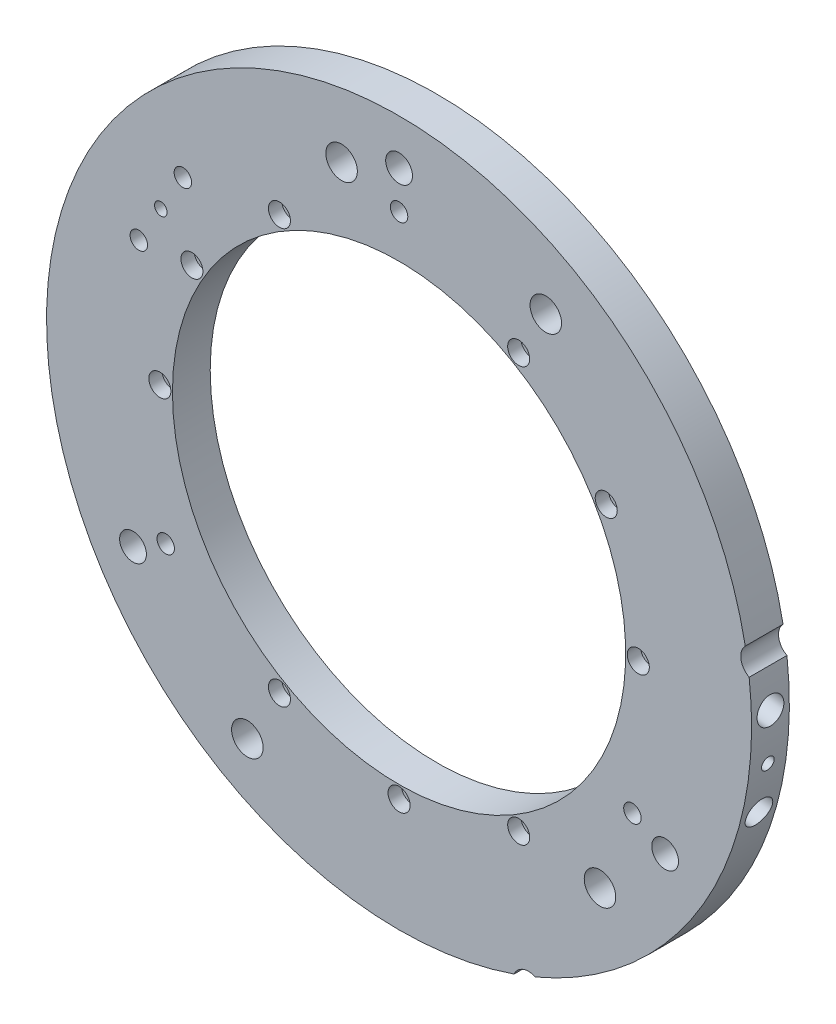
from build123d import *

# Parameters (mm, degrees)
SKETCH1_R           = 88.9
SKETCH1_R_2         = 57.15
BOSS_EXTRUDE1_DEPTH = 9.525
SKETCH2_R           = 3.3782
CUT_EXTRUDE1_DEPTH  = 127.083883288
SKETCH3_R           = 1.4732
CUT_EXTRUDE2_DEPTH  = 127.083883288
SKETCH5_R           = 2.778125
CUT_EXTRUDE4_DEPTH  = 3.3528
SKETCH7_R           = 2.1971
CUT_EXTRUDE6_DEPTH  = 127.083883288
SKETCH10_R          = 3.9751
CUT_EXTRUDE7_DEPTH  = 127.083883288
SKETCH15_R          = 3.3782
CUT_EXTRUDE8_DEPTH  = 19.05
SKETCH16_R          = 1.5875
CUT_EXTRUDE9_DEPTH  = 6.35
SKETCH18_R          = 1.5875
CUT_EXTRUDE10_DEPTH = 6.35
SKETCH19_R          = 3.3782
CUT_EXTRUDE12_DEPTH = 19.05
SKETCH20_R          = 3.3782
CUT_EXTRUDE13_DEPTH = 9.525
SKETCH21_R          = 2.1971
CUT_EXTRUDE14_DEPTH = 127.083883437
SKETCH22_R          = 1.5875
CUT_EXTRUDE15_DEPTH = 6.35


with BuildPart() as part:
    # Sketch1 → Boss-Extrude1 (new body)
    with BuildSketch(Plane.XY):
        with Locations(Location((0, 0, 0), (0, 0, 180))):
            Circle(SKETCH1_R)
        with Locations(Location((0, 0, 0), (0, 0, 180))):
            Circle(SKETCH1_R_2, mode=Mode.SUBTRACT)
    extrude(amount=BOSS_EXTRUDE1_DEPTH)

    # Sketch2 → Cut-Extrude1 (cut, through all)
    with BuildSketch(Plane.XY.offset(9.525)):
        with Locations((0, 77.47)):
            Circle(SKETCH2_R)
        with Locations((67.090988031, -38.735)):
            Circle(SKETCH2_R)
        with Locations((-67.090988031, -38.735)):
            Circle(SKETCH2_R)
    extrude(amount=-CUT_EXTRUDE1_DEPTH, mode=Mode.SUBTRACT)

    # Sketch3 → Cut-Extrude2 (cut, through all)
    with BuildSketch(Plane.XY.offset(9.525)):
        with Locations((0, -60.325)):
            Circle(SKETCH3_R)
        with Locations((-30.1625, -52.242982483)):
            Circle(SKETCH3_R)
        with Locations((30.1625, -52.242982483)):
            Circle(SKETCH3_R)
        with Locations((-30.1625, 52.242982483)):
            Circle(SKETCH3_R)
        with Locations((-52.242982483, 30.1625)):
            Circle(SKETCH3_R)
        with Locations((-60.325, 0)):
            Circle(SKETCH3_R)
        with Locations((60.325, 0)):
            Circle(SKETCH3_R)
        with Locations((52.242982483, 30.1625)):
            Circle(SKETCH3_R)
        with Locations((30.1625, 52.242982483)):
            Circle(SKETCH3_R)
    extrude(amount=-CUT_EXTRUDE2_DEPTH, mode=Mode.SUBTRACT)

    # Sketch5 → Cut-Extrude4 (cut)
    with BuildSketch(Plane.XY.offset(9.525)):
        with Locations((-30.1625, -52.242982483)):
            Circle(SKETCH5_R)
        with Locations((0, -60.325)):
            Circle(SKETCH5_R)
        with Locations((30.1625, -52.242982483)):
            Circle(SKETCH5_R)
        with Locations((-30.1625, 52.242982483)):
            Circle(SKETCH5_R)
        with Locations((-52.242982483, 30.1625)):
            Circle(SKETCH5_R)
        with Locations((-60.325, 0)):
            Circle(SKETCH5_R)
        with Locations((60.325, 0)):
            Circle(SKETCH5_R)
        with Locations((52.242982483, 30.1625)):
            Circle(SKETCH5_R)
        with Locations((30.1625, 52.242982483)):
            Circle(SKETCH5_R)
    extrude(amount=-CUT_EXTRUDE4_DEPTH, mode=Mode.SUBTRACT)

    # Sketch7 → Cut-Extrude6 (cut, through all)
    with BuildSketch(Plane.XY.offset(9.525)):
        with Locations((0, 67.945)):
            Circle(SKETCH7_R)
        with Locations((58.84209606, -33.9725)):
            Circle(SKETCH7_R)
        with Locations((-58.84209606, -33.9725)):
            Circle(SKETCH7_R)
    extrude(amount=-CUT_EXTRUDE6_DEPTH, mode=Mode.SUBTRACT)

    # Sketch10 → Cut-Extrude7 (cut, through all)
    with BuildSketch(Plane(origin=(0, 0, 0), x_dir=(-1, 0, 0), z_dir=(0, 0, -1))):
        with Locations((-37.000532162, 64.086801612)):
            Circle(SKETCH10_R)
        with Locations((14.494073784, 71.491727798)):
            Circle(SKETCH10_R)
        with Locations((-50.669320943, -54.401961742)):
            Circle(SKETCH10_R)
        with Locations((38.25509156, -66.25976223)):
            Circle(SKETCH10_R)
        with Locations((-32.666231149, -85.584227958)):
            Circle(SKETCH10_R)
        with Locations((-90.133731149, 13.952401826)):
            Circle(SKETCH10_R)
    extrude(amount=-CUT_EXTRUDE7_DEPTH, mode=Mode.SUBTRACT)

    # Sketch15 → Cut-Extrude8 (cut)
    with BuildSketch(Plane(origin=(88.237352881, -10.834184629, 0), x_dir=(-0.12186934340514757, -0.9925461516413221, 0), z_dir=(0.9925461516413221, -0.12186934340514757, 0))):
        with Locations(Location((11.9126, -4.7625, 0), (0, 0, 180))):
            Circle(SKETCH15_R)
        with Locations(Location((-11.9126, -4.7625, 0), (0, 0, 180))):
            Circle(SKETCH15_R)
    extrude(amount=-CUT_EXTRUDE8_DEPTH, mode=Mode.SUBTRACT)

    # Sketch16 → Cut-Extrude9 (cut)
    with BuildSketch(Plane(origin=(88.237352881, -10.834184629, 0), x_dir=(-0.12186934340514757, -0.9925461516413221, 0), z_dir=(0.9925461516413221, -0.12186934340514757, 0))):
        with Locations(Location((0, -4.7625, 0), (0, 0, 180))):
            Circle(SKETCH16_R)
    extrude(amount=-CUT_EXTRUDE9_DEPTH, mode=Mode.SUBTRACT)

    # Sketch18 → Cut-Extrude10 (cut)
    with BuildSketch(Plane(origin=(-57.143818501, -68.101350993, 0), x_dir=(-0.7660444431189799, 0.6427876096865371, 0), z_dir=(-0.6427876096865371, -0.7660444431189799, 0))):
        with Locations(Location((0, -4.7625, 0), (0, 0, 180))):
            Circle(SKETCH18_R)
    extrude(amount=-CUT_EXTRUDE10_DEPTH, mode=Mode.SUBTRACT)

    # Sketch19 → Cut-Extrude12 (cut)
    with BuildSketch(Plane(origin=(-57.143818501, -68.101350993, 0), x_dir=(-0.7660444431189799, 0.6427876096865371, 0), z_dir=(-0.6427876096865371, -0.7660444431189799, 0))):
        with Locations(Location((11.9126, -4.7625, 0), (0, 0, 180))):
            Circle(SKETCH19_R)
    extrude(amount=-CUT_EXTRUDE12_DEPTH, mode=Mode.SUBTRACT)

    # Sketch20 → Cut-Extrude13 (cut)
    with BuildSketch(Plane(origin=(-57.143818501, -68.101350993, 0), x_dir=(-0.7660444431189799, 0.6427876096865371, 0), z_dir=(-0.6427876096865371, -0.7660444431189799, 0))):
        with Locations(Location((-11.9126, -4.7625, 0), (0, 0, 180))):
            Circle(SKETCH20_R)
    extrude(amount=-CUT_EXTRUDE13_DEPTH, mode=Mode.SUBTRACT)

    # Sketch21 → Cut-Extrude14 (cut, through all)
    with BuildSketch(Plane.XY.offset(9.525)):
        with Locations((-54.518251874, 48.165572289)):
            Circle(SKETCH21_R)
        with Locations((-65.630751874, 28.91815769)):
            Circle(SKETCH21_R)
    extrude(amount=-CUT_EXTRUDE14_DEPTH, mode=Mode.SUBTRACT)

    # Sketch22 → Cut-Extrude15 (cut)
    with BuildSketch(Plane.XY.offset(9.525)):
        with Locations((-60.074501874, 38.54186499)):
            Circle(SKETCH22_R)
    extrude(amount=-CUT_EXTRUDE15_DEPTH, mode=Mode.SUBTRACT)


solid = part.part
